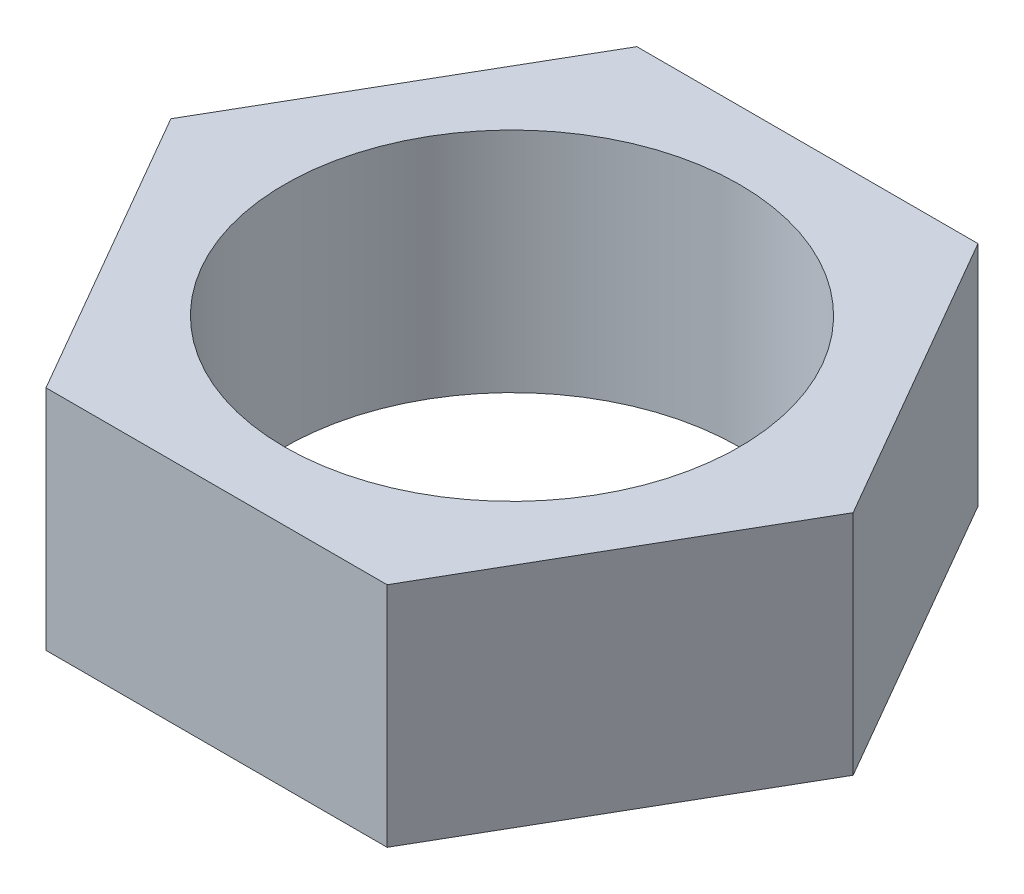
ISO-10303-21;
HEADER;
FILE_DESCRIPTION(('STEP AP214'),'2;1');
FILE_NAME('part.step','',(''),(''),'','','');
FILE_SCHEMA(('AUTOMOTIVE_DESIGN { 1 0 10303 214 1 1 1 1 }'));
ENDSEC;
DATA;
#1=APPLICATION_CONTEXT('core data for automotive mechanical design processes');
#2=APPLICATION_PROTOCOL_DEFINITION('international standard','automotive_design',2000,#1);
#3=PRODUCT_CONTEXT('',#1,'mechanical');
#4=PRODUCT('Part','Part','',(#3));
#5=PRODUCT_RELATED_PRODUCT_CATEGORY('part','',(#4));
#6=PRODUCT_DEFINITION_FORMATION('','',#4);
#7=PRODUCT_DEFINITION_CONTEXT('part definition',#1,'design');
#8=PRODUCT_DEFINITION('design','',#6,#7);
#9=PRODUCT_DEFINITION_SHAPE('','',#8);
#10=(LENGTH_UNIT() NAMED_UNIT(*) SI_UNIT(.MILLI.,.METRE.));
#11=(NAMED_UNIT(*) PLANE_ANGLE_UNIT() SI_UNIT($,.RADIAN.));
#12=(NAMED_UNIT(*) SI_UNIT($,.STERADIAN.) SOLID_ANGLE_UNIT());
#13=UNCERTAINTY_MEASURE_WITH_UNIT(LENGTH_MEASURE(1.E-05),#10,'distance_accuracy_value','');
#14=(GEOMETRIC_REPRESENTATION_CONTEXT(3) GLOBAL_UNCERTAINTY_ASSIGNED_CONTEXT((#13)) GLOBAL_UNIT_ASSIGNED_CONTEXT((#10,
#11,#12)) REPRESENTATION_CONTEXT('',''));
#15=CARTESIAN_POINT('',(0.,0.,0.));
#16=DIRECTION('',(0.,0.,1.));
#17=DIRECTION('',(1.,0.,0.));
#18=AXIS2_PLACEMENT_3D('',#15,#16,#17);
#19=CARTESIAN_POINT('',(0.,2.,0.));
#20=DIRECTION('',(0.,1.,0.));
#21=DIRECTION('',(0.,0.,1.));
#22=AXIS2_PLACEMENT_3D('',#19,#20,#21);
#23=PLANE('',#22);
#24=DIRECTION('',(-0.5,0.,0.866025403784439));
#25=VECTOR('',#24,1.);
#26=CARTESIAN_POINT('',(-1.5,2.,-2.59807621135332));
#27=LINE('',#26,#25);
#28=CARTESIAN_POINT('',(-1.5,2.,-2.59807621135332));
#29=VERTEX_POINT('',#28);
#30=CARTESIAN_POINT('',(-3.,2.,0.));
#31=VERTEX_POINT('',#30);
#32=EDGE_CURVE('E152',#29,#31,#27,.T.);
#33=ORIENTED_EDGE('',*,*,#32,.T.);
#34=DIRECTION('',(0.5,0.,0.866025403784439));
#35=VECTOR('',#34,1.);
#36=CARTESIAN_POINT('',(-3.,2.,0.));
#37=LINE('',#36,#35);
#38=CARTESIAN_POINT('',(-1.5,2.,2.59807621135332));
#39=VERTEX_POINT('',#38);
#40=EDGE_CURVE('E100',#31,#39,#37,.T.);
#41=ORIENTED_EDGE('',*,*,#40,.T.);
#42=DIRECTION('',(1.,0.,0.));
#43=VECTOR('',#42,1.);
#44=CARTESIAN_POINT('',(-1.5,2.,2.59807621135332));
#45=LINE('',#44,#43);
#46=CARTESIAN_POINT('',(1.5,2.,2.59807621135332));
#47=VERTEX_POINT('',#46);
#48=EDGE_CURVE('E113',#39,#47,#45,.T.);
#49=ORIENTED_EDGE('',*,*,#48,.T.);
#50=DIRECTION('',(0.5,0.,-0.866025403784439));
#51=VECTOR('',#50,1.);
#52=CARTESIAN_POINT('',(1.5,2.,2.59807621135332));
#53=LINE('',#52,#51);
#54=CARTESIAN_POINT('',(3.,2.,0.));
#55=VERTEX_POINT('',#54);
#56=EDGE_CURVE('E107',#47,#55,#53,.T.);
#57=ORIENTED_EDGE('',*,*,#56,.T.);
#58=DIRECTION('',(-0.5,0.,-0.866025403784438));
#59=VECTOR('',#58,1.);
#60=CARTESIAN_POINT('',(3.,2.,0.));
#61=LINE('',#60,#59);
#62=CARTESIAN_POINT('',(1.5,2.,-2.59807621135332));
#63=VERTEX_POINT('',#62);
#64=EDGE_CURVE('E111',#55,#63,#61,.T.);
#65=ORIENTED_EDGE('',*,*,#64,.T.);
#66=DIRECTION('',(-1.,0.,0.));
#67=VECTOR('',#66,1.);
#68=CARTESIAN_POINT('',(1.5,2.,-2.59807621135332));
#69=LINE('',#68,#67);
#70=EDGE_CURVE('E63',#63,#29,#69,.T.);
#71=ORIENTED_EDGE('',*,*,#70,.T.);
#72=EDGE_LOOP('',(#33,#41,#49,#57,#65,#71));
#73=FACE_BOUND('',#72,.T.);
#74=CARTESIAN_POINT('',(0.,2.,0.));
#75=DIRECTION('',(0.,1.,0.));
#76=DIRECTION('',(0.,0.,1.));
#77=AXIS2_PLACEMENT_3D('',#74,#75,#76);
#78=CIRCLE('',#77,2.);
#79=CARTESIAN_POINT('',(0.,2.,2.));
#80=VERTEX_POINT('',#79);
#81=EDGE_CURVE('E140',#80,#80,#78,.T.);
#82=ORIENTED_EDGE('',*,*,#81,.F.);
#83=EDGE_LOOP('',(#82));
#84=FACE_BOUND('',#83,.T.);
#85=ADVANCED_FACE('F45',(#73,#84),#23,.T.);
#86=CARTESIAN_POINT('',(0.,0.,0.));
#87=DIRECTION('',(0.,1.,0.));
#88=DIRECTION('',(0.,0.,1.));
#89=AXIS2_PLACEMENT_3D('',#86,#87,#88);
#90=PLANE('',#89);
#91=DIRECTION('',(-0.5,0.,0.866025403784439));
#92=VECTOR('',#91,1.);
#93=CARTESIAN_POINT('',(-1.5,0.,-2.59807621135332));
#94=LINE('',#93,#92);
#95=CARTESIAN_POINT('',(-1.5,0.,-2.59807621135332));
#96=VERTEX_POINT('',#95);
#97=CARTESIAN_POINT('',(-3.,0.,0.));
#98=VERTEX_POINT('',#97);
#99=EDGE_CURVE('E135',#96,#98,#94,.T.);
#100=ORIENTED_EDGE('',*,*,#99,.F.);
#101=DIRECTION('',(-1.,0.,0.));
#102=VECTOR('',#101,1.);
#103=CARTESIAN_POINT('',(1.5,0.,-2.59807621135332));
#104=LINE('',#103,#102);
#105=CARTESIAN_POINT('',(1.5,0.,-2.59807621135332));
#106=VERTEX_POINT('',#105);
#107=EDGE_CURVE('E92',#106,#96,#104,.T.);
#108=ORIENTED_EDGE('',*,*,#107,.F.);
#109=DIRECTION('',(-0.5,0.,-0.866025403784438));
#110=VECTOR('',#109,1.);
#111=CARTESIAN_POINT('',(3.,0.,0.));
#112=LINE('',#111,#110);
#113=CARTESIAN_POINT('',(3.,0.,0.));
#114=VERTEX_POINT('',#113);
#115=EDGE_CURVE('E86',#114,#106,#112,.T.);
#116=ORIENTED_EDGE('',*,*,#115,.F.);
#117=DIRECTION('',(0.5,0.,-0.866025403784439));
#118=VECTOR('',#117,1.);
#119=CARTESIAN_POINT('',(1.5,0.,2.59807621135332));
#120=LINE('',#119,#118);
#121=CARTESIAN_POINT('',(1.5,0.,2.59807621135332));
#122=VERTEX_POINT('',#121);
#123=EDGE_CURVE('E122',#122,#114,#120,.T.);
#124=ORIENTED_EDGE('',*,*,#123,.F.);
#125=DIRECTION('',(1.,0.,0.));
#126=VECTOR('',#125,1.);
#127=CARTESIAN_POINT('',(-1.5,0.,2.59807621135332));
#128=LINE('',#127,#126);
#129=CARTESIAN_POINT('',(-1.5,0.,2.59807621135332));
#130=VERTEX_POINT('',#129);
#131=EDGE_CURVE('E143',#130,#122,#128,.T.);
#132=ORIENTED_EDGE('',*,*,#131,.F.);
#133=DIRECTION('',(0.5,0.,0.866025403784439));
#134=VECTOR('',#133,1.);
#135=CARTESIAN_POINT('',(-3.,0.,0.));
#136=LINE('',#135,#134);
#137=EDGE_CURVE('E139',#98,#130,#136,.T.);
#138=ORIENTED_EDGE('',*,*,#137,.F.);
#139=EDGE_LOOP('',(#100,#108,#116,#124,#132,#138));
#140=FACE_BOUND('',#139,.T.);
#141=CARTESIAN_POINT('',(0.,0.,0.));
#142=DIRECTION('',(0.,1.,0.));
#143=DIRECTION('',(0.,0.,1.));
#144=AXIS2_PLACEMENT_3D('',#141,#142,#143);
#145=CIRCLE('',#144,2.);
#146=CARTESIAN_POINT('',(0.,0.,2.));
#147=VERTEX_POINT('',#146);
#148=EDGE_CURVE('E249',#147,#147,#145,.T.);
#149=ORIENTED_EDGE('',*,*,#148,.T.);
#150=EDGE_LOOP('',(#149));
#151=FACE_BOUND('',#150,.T.);
#152=ADVANCED_FACE('F165',(#140,#151),#90,.F.);
#153=CARTESIAN_POINT('',(-1.5,2.,-2.59807621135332));
#154=DIRECTION('',(0.866025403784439,0.,0.5));
#155=DIRECTION('',(0.5,0.,-0.866025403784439));
#156=AXIS2_PLACEMENT_3D('',#153,#154,#155);
#157=PLANE('',#156);
#158=ORIENTED_EDGE('',*,*,#99,.T.);
#159=DIRECTION('',(0.,-1.,0.));
#160=VECTOR('',#159,1.);
#161=CARTESIAN_POINT('',(-3.,2.,0.));
#162=LINE('',#161,#160);
#163=EDGE_CURVE('E11',#31,#98,#162,.T.);
#164=ORIENTED_EDGE('',*,*,#163,.F.);
#165=ORIENTED_EDGE('',*,*,#32,.F.);
#166=DIRECTION('',(0.,-1.,0.));
#167=VECTOR('',#166,1.);
#168=CARTESIAN_POINT('',(-1.5,2.,-2.59807621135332));
#169=LINE('',#168,#167);
#170=EDGE_CURVE('E131',#29,#96,#169,.T.);
#171=ORIENTED_EDGE('',*,*,#170,.T.);
#172=EDGE_LOOP('',(#158,#164,#165,#171));
#173=FACE_BOUND('',#172,.T.);
#174=ADVANCED_FACE('F47',(#173),#157,.F.);
#175=CARTESIAN_POINT('',(-3.,2.,0.));
#176=DIRECTION('',(0.866025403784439,0.,-0.5));
#177=DIRECTION('',(-0.5,0.,-0.866025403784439));
#178=AXIS2_PLACEMENT_3D('',#175,#176,#177);
#179=PLANE('',#178);
#180=ORIENTED_EDGE('',*,*,#137,.T.);
#181=DIRECTION('',(0.,-1.,0.));
#182=VECTOR('',#181,1.);
#183=CARTESIAN_POINT('',(-1.5,2.,2.59807621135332));
#184=LINE('',#183,#182);
#185=EDGE_CURVE('E55',#39,#130,#184,.T.);
#186=ORIENTED_EDGE('',*,*,#185,.F.);
#187=ORIENTED_EDGE('',*,*,#40,.F.);
#188=ORIENTED_EDGE('',*,*,#163,.T.);
#189=EDGE_LOOP('',(#180,#186,#187,#188));
#190=FACE_BOUND('',#189,.T.);
#191=ADVANCED_FACE('F190',(#190),#179,.F.);
#192=CARTESIAN_POINT('',(-1.5,2.,2.59807621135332));
#193=DIRECTION('',(0.,0.,-1.));
#194=DIRECTION('',(-1.,0.,0.));
#195=AXIS2_PLACEMENT_3D('',#192,#193,#194);
#196=PLANE('',#195);
#197=ORIENTED_EDGE('',*,*,#131,.T.);
#198=DIRECTION('',(0.,-1.,0.));
#199=VECTOR('',#198,1.);
#200=CARTESIAN_POINT('',(1.5,2.,2.59807621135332));
#201=LINE('',#200,#199);
#202=EDGE_CURVE('E124',#47,#122,#201,.T.);
#203=ORIENTED_EDGE('',*,*,#202,.F.);
#204=ORIENTED_EDGE('',*,*,#48,.F.);
#205=ORIENTED_EDGE('',*,*,#185,.T.);
#206=EDGE_LOOP('',(#197,#203,#204,#205));
#207=FACE_BOUND('',#206,.T.);
#208=ADVANCED_FACE('F162',(#207),#196,.F.);
#209=CARTESIAN_POINT('',(1.5,2.,2.59807621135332));
#210=DIRECTION('',(-0.866025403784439,0.,-0.5));
#211=DIRECTION('',(-0.5,0.,0.866025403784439));
#212=AXIS2_PLACEMENT_3D('',#209,#210,#211);
#213=PLANE('',#212);
#214=ORIENTED_EDGE('',*,*,#123,.T.);
#215=DIRECTION('',(0.,-1.,0.));
#216=VECTOR('',#215,1.);
#217=CARTESIAN_POINT('',(3.,2.,0.));
#218=LINE('',#217,#216);
#219=EDGE_CURVE('E119',#55,#114,#218,.T.);
#220=ORIENTED_EDGE('',*,*,#219,.F.);
#221=ORIENTED_EDGE('',*,*,#56,.F.);
#222=ORIENTED_EDGE('',*,*,#202,.T.);
#223=EDGE_LOOP('',(#214,#220,#221,#222));
#224=FACE_BOUND('',#223,.T.);
#225=ADVANCED_FACE('F120',(#224),#213,.F.);
#226=CARTESIAN_POINT('',(3.,2.,0.));
#227=DIRECTION('',(-0.866025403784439,0.,0.5));
#228=DIRECTION('',(0.5,0.,0.866025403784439));
#229=AXIS2_PLACEMENT_3D('',#226,#227,#228);
#230=PLANE('',#229);
#231=ORIENTED_EDGE('',*,*,#115,.T.);
#232=DIRECTION('',(0.,-1.,0.));
#233=VECTOR('',#232,1.);
#234=CARTESIAN_POINT('',(1.5,2.,-2.59807621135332));
#235=LINE('',#234,#233);
#236=EDGE_CURVE('E125',#63,#106,#235,.T.);
#237=ORIENTED_EDGE('',*,*,#236,.F.);
#238=ORIENTED_EDGE('',*,*,#64,.F.);
#239=ORIENTED_EDGE('',*,*,#219,.T.);
#240=EDGE_LOOP('',(#231,#237,#238,#239));
#241=FACE_BOUND('',#240,.T.);
#242=ADVANCED_FACE('F127',(#241),#230,.F.);
#243=CARTESIAN_POINT('',(1.5,2.,-2.59807621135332));
#244=DIRECTION('',(0.,0.,1.));
#245=DIRECTION('',(1.,0.,0.));
#246=AXIS2_PLACEMENT_3D('',#243,#244,#245);
#247=PLANE('',#246);
#248=ORIENTED_EDGE('',*,*,#107,.T.);
#249=ORIENTED_EDGE('',*,*,#170,.F.);
#250=ORIENTED_EDGE('',*,*,#70,.F.);
#251=ORIENTED_EDGE('',*,*,#236,.T.);
#252=EDGE_LOOP('',(#248,#249,#250,#251));
#253=FACE_BOUND('',#252,.T.);
#254=ADVANCED_FACE('F170',(#253),#247,.F.);
#255=CARTESIAN_POINT('',(0.,2.,0.));
#256=DIRECTION('',(0.,-1.,0.));
#257=DIRECTION('',(0.,0.,-1.));
#258=AXIS2_PLACEMENT_3D('',#255,#256,#257);
#259=CYLINDRICAL_SURFACE('',#258,2.);
#260=ORIENTED_EDGE('',*,*,#81,.T.);
#261=EDGE_LOOP('',(#260));
#262=FACE_BOUND('',#261,.T.);
#263=ORIENTED_EDGE('',*,*,#148,.F.);
#264=EDGE_LOOP('',(#263));
#265=FACE_BOUND('',#264,.T.);
#266=ADVANCED_FACE('F172',(#262,#265),#259,.F.);
#267=CLOSED_SHELL('',(#85,#152,#174,#191,#208,#225,#242,#254,#266));
#268=MANIFOLD_SOLID_BREP('B2',#267);
#269=ADVANCED_BREP_SHAPE_REPRESENTATION('',(#18,#268),#14);
#270=SHAPE_DEFINITION_REPRESENTATION(#9,#269);
ENDSEC;
END-ISO-10303-21;
